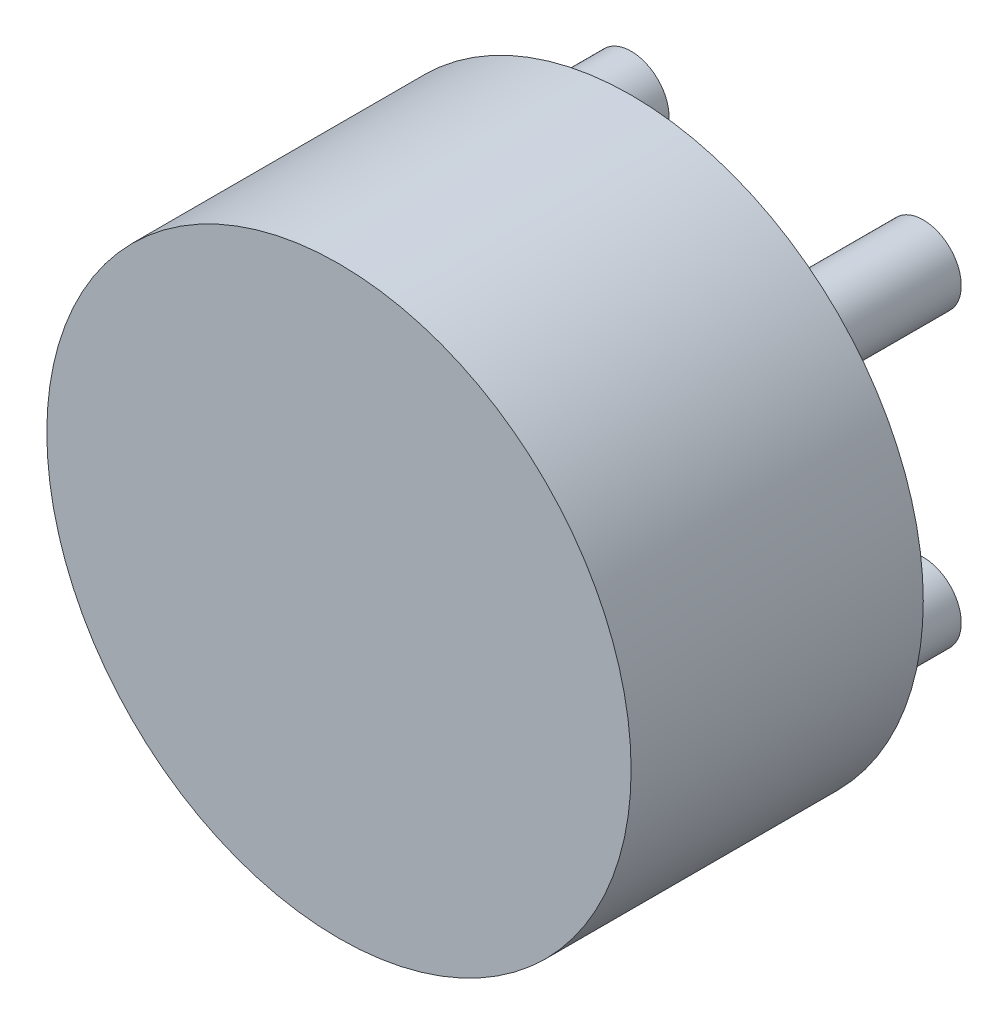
from build123d import *

# Parameters (mm, degrees)
SKETCH_1_R        = 5.08
EXTRUDE_1_DEPTH   = 5.08
SKETCH_2_R        = 0.6604
EXTRUDE_2_DEPTH   = 2.54
EXTRUDE_2_2_DEPTH = 2.54
EXTRUDE_2_3_DEPTH = 2.54
EXTRUDE_2_4_DEPTH = 2.54


with BuildPart() as part:
    # Sketch 1 → Extrude 1 (new body)
    with BuildSketch(Plane.XY):
        Circle(SKETCH_1_R)
    extrude(amount=EXTRUDE_1_DEPTH)


with BuildPart() as body_2:
    # Sketch 2 → Extrude 2 (new body)
    with BuildSketch(Plane(origin=(0, 0, 0), x_dir=(-1, 0, 0), z_dir=(0, 0, -1))):
        with Locations((2.54, 2.54)):
            Circle(SKETCH_2_R)
    extrude(amount=EXTRUDE_2_DEPTH)


with BuildPart() as body_3:
    # Sketch 2 → Extrude 2 2 (new body)
    with BuildSketch(Plane(origin=(0, 0, 0), x_dir=(-1, 0, 0), z_dir=(0, 0, -1))):
        with Locations((-2.54, 2.54)):
            Circle(SKETCH_2_R)
    extrude(amount=EXTRUDE_2_2_DEPTH)


with BuildPart() as body_4:
    # Sketch 2 → Extrude 2 3 (new body)
    with BuildSketch(Plane(origin=(0, 0, 0), x_dir=(-1, 0, 0), z_dir=(0, 0, -1))):
        with Locations((-2.54, -2.54)):
            Circle(SKETCH_2_R)
    extrude(amount=EXTRUDE_2_3_DEPTH)


with BuildPart() as body_5:
    # Sketch 2 → Extrude 2 4 (new body)
    with BuildSketch(Plane(origin=(0, 0, 0), x_dir=(-1, 0, 0), z_dir=(0, 0, -1))):
        with Locations((2.54, -2.54)):
            Circle(SKETCH_2_R)
    extrude(amount=EXTRUDE_2_4_DEPTH)


solid = Compound([part.part, body_2.part, body_3.part, body_4.part, body_5.part])
